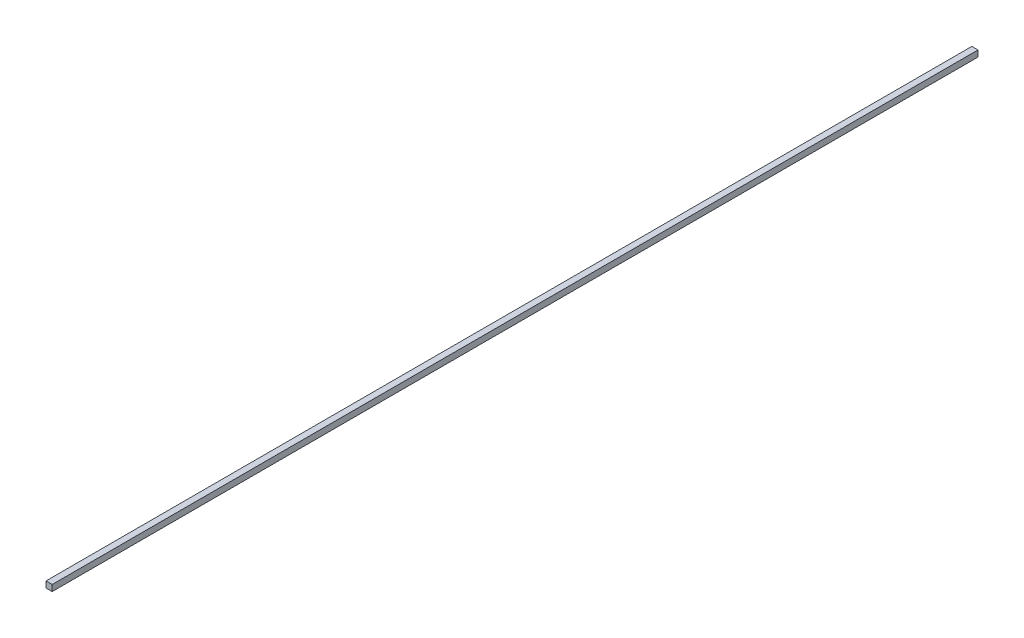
from build123d import *

# Parameters (mm, degrees)
ESQUISSE1_W      = 2
ESQUISSE1_H      = 2
EXTRUSION1_DEPTH = 150


with BuildPart() as part:
    # Esquisse1 → Extrusion1 (new, symmetric)
    with BuildSketch(Plane.XY):
        Rectangle(ESQUISSE1_W, ESQUISSE1_H)
    extrude(amount=EXTRUSION1_DEPTH, both=True)


solid = part.part
